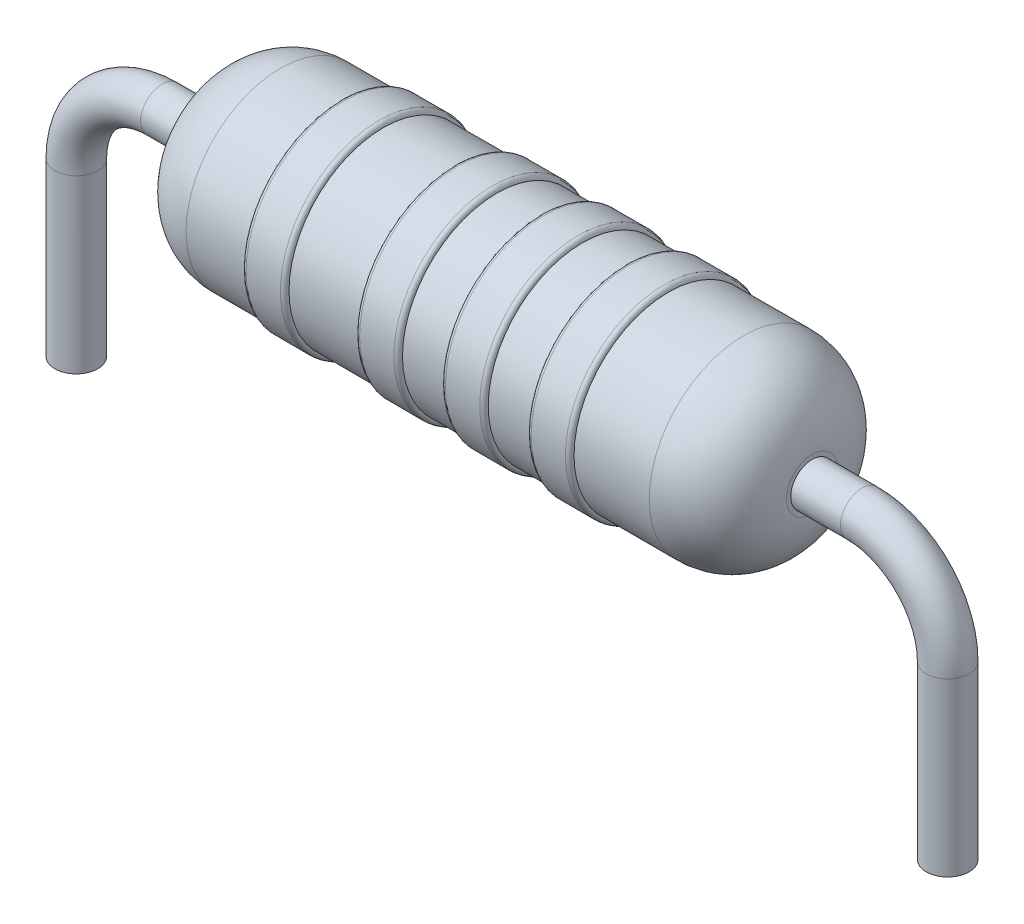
ISO-10303-21;
HEADER;
FILE_DESCRIPTION(('STEP AP214'),'2;1');
FILE_NAME('part.step','',(''),(''),'','','');
FILE_SCHEMA(('AUTOMOTIVE_DESIGN { 1 0 10303 214 1 1 1 1 }'));
ENDSEC;
DATA;
#1=APPLICATION_CONTEXT('core data for automotive mechanical design processes');
#2=APPLICATION_PROTOCOL_DEFINITION('international standard','automotive_design',2000,#1);
#3=PRODUCT_CONTEXT('',#1,'mechanical');
#4=PRODUCT('Part','Part','',(#3));
#5=PRODUCT_RELATED_PRODUCT_CATEGORY('part','',(#4));
#6=PRODUCT_DEFINITION_FORMATION('','',#4);
#7=PRODUCT_DEFINITION_CONTEXT('part definition',#1,'design');
#8=PRODUCT_DEFINITION('design','',#6,#7);
#9=PRODUCT_DEFINITION_SHAPE('','',#8);
#10=(LENGTH_UNIT() NAMED_UNIT(*) SI_UNIT(.MILLI.,.METRE.));
#11=(NAMED_UNIT(*) PLANE_ANGLE_UNIT() SI_UNIT($,.RADIAN.));
#12=(NAMED_UNIT(*) SI_UNIT($,.STERADIAN.) SOLID_ANGLE_UNIT());
#13=UNCERTAINTY_MEASURE_WITH_UNIT(LENGTH_MEASURE(1.E-05),#10,'distance_accuracy_value','');
#14=(GEOMETRIC_REPRESENTATION_CONTEXT(3) GLOBAL_UNCERTAINTY_ASSIGNED_CONTEXT((#13)) GLOBAL_UNIT_ASSIGNED_CONTEXT((#10,
#11,#12)) REPRESENTATION_CONTEXT('',''));
#15=CARTESIAN_POINT('',(0.,0.,0.));
#16=DIRECTION('',(0.,0.,1.));
#17=DIRECTION('',(1.,0.,0.));
#18=AXIS2_PLACEMENT_3D('',#15,#16,#17);
#19=CARTESIAN_POINT('',(-3.5,0.,0.));
#20=DIRECTION('',(1.,0.,0.));
#21=DIRECTION('',(0.,0.,-1.));
#22=AXIS2_PLACEMENT_3D('',#19,#20,#21);
#23=PLANE('',#22);
#24=CARTESIAN_POINT('',(-3.5,0.,0.));
#25=DIRECTION('',(-1.,0.,0.));
#26=DIRECTION('',(0.,0.,1.));
#27=AXIS2_PLACEMENT_3D('',#24,#25,#26);
#28=CIRCLE('',#27,0.299999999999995);
#29=CARTESIAN_POINT('',(-3.5,0.,0.299999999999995));
#30=VERTEX_POINT('',#29);
#31=EDGE_CURVE('E98',#30,#30,#28,.T.);
#32=ORIENTED_EDGE('',*,*,#31,.T.);
#33=EDGE_LOOP('',(#32));
#34=FACE_BOUND('',#33,.T.);
#35=CARTESIAN_POINT('',(-3.5,0.,0.));
#36=DIRECTION('',(1.,0.,0.));
#37=DIRECTION('',(0.,0.,-1.));
#38=AXIS2_PLACEMENT_3D('',#35,#36,#37);
#39=CIRCLE('',#38,0.25);
#40=CARTESIAN_POINT('',(-3.5,0.,-0.25));
#41=VERTEX_POINT('',#40);
#42=EDGE_CURVE('E10',#41,#41,#39,.F.);
#43=ORIENTED_EDGE('',*,*,#42,.F.);
#44=EDGE_LOOP('',(#43));
#45=FACE_BOUND('',#44,.T.);
#46=ADVANCED_FACE('F39',(#34,#45),#23,.F.);
#47=CARTESIAN_POINT('',(-54.2686615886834,0.,0.));
#48=DIRECTION('',(-1.,0.,0.));
#49=DIRECTION('',(0.,0.,1.));
#50=AXIS2_PLACEMENT_3D('',#47,#48,#49);
#51=CYLINDRICAL_SURFACE('',#50,1.1);
#52=CARTESIAN_POINT('',(0.322975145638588,0.,0.));
#53=DIRECTION('',(-1.,0.,0.));
#54=DIRECTION('',(0.,0.,1.));
#55=AXIS2_PLACEMENT_3D('',#52,#53,#54);
#56=CIRCLE('',#55,1.1);
#57=CARTESIAN_POINT('',(0.322975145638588,0.,1.1));
#58=VERTEX_POINT('',#57);
#59=EDGE_CURVE('E86',#58,#58,#56,.T.);
#60=ORIENTED_EDGE('',*,*,#59,.T.);
#61=EDGE_LOOP('',(#60));
#62=FACE_BOUND('',#61,.T.);
#63=CARTESIAN_POINT('',(-0.177024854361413,0.,0.));
#64=DIRECTION('',(1.,0.,0.));
#65=DIRECTION('',(0.,0.,-1.));
#66=AXIS2_PLACEMENT_3D('',#63,#64,#65);
#67=CIRCLE('',#66,1.1);
#68=CARTESIAN_POINT('',(-0.177024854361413,0.,-1.1));
#69=VERTEX_POINT('',#68);
#70=EDGE_CURVE('E95',#69,#69,#67,.T.);
#71=ORIENTED_EDGE('',*,*,#70,.T.);
#72=EDGE_LOOP('',(#71));
#73=FACE_BOUND('',#72,.T.);
#74=ADVANCED_FACE('F156',(#62,#73),#51,.T.);
#75=CARTESIAN_POINT('',(4.3261723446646,0.,0.));
#76=DIRECTION('',(1.,0.,0.));
#77=DIRECTION('',(0.,0.,-1.));
#78=AXIS2_PLACEMENT_3D('',#75,#76,#77);
#79=CYLINDRICAL_SURFACE('',#78,1.15);
#80=CARTESIAN_POINT('',(-0.627024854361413,0.,0.));
#81=DIRECTION('',(-1.,0.,0.));
#82=DIRECTION('',(0.,0.,1.));
#83=AXIS2_PLACEMENT_3D('',#80,#81,#82);
#84=CIRCLE('',#83,1.15);
#85=CARTESIAN_POINT('',(-0.627024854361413,0.,1.15));
#86=VERTEX_POINT('',#85);
#87=EDGE_CURVE('E62',#86,#86,#84,.F.);
#88=ORIENTED_EDGE('',*,*,#87,.T.);
#89=EDGE_LOOP('',(#88));
#90=FACE_BOUND('',#89,.T.);
#91=CARTESIAN_POINT('',(-0.227024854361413,0.,0.));
#92=DIRECTION('',(1.,0.,0.));
#93=DIRECTION('',(0.,0.,-1.));
#94=AXIS2_PLACEMENT_3D('',#91,#92,#93);
#95=CIRCLE('',#94,1.15);
#96=CARTESIAN_POINT('',(-0.227024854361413,0.,-1.15));
#97=VERTEX_POINT('',#96);
#98=EDGE_CURVE('E65',#97,#97,#95,.F.);
#99=ORIENTED_EDGE('',*,*,#98,.T.);
#100=EDGE_LOOP('',(#99));
#101=FACE_BOUND('',#100,.T.);
#102=ADVANCED_FACE('F162',(#90,#101),#79,.T.);
#103=CARTESIAN_POINT('',(-1.5,0.,0.));
#104=DIRECTION('',(1.,0.,0.));
#105=DIRECTION('',(0.,0.,-1.));
#106=AXIS2_PLACEMENT_3D('',#103,#104,#105);
#107=CIRCLE('',#106,1.1);
#108=CARTESIAN_POINT('',(-1.5,0.,-1.1));
#109=VERTEX_POINT('',#108);
#110=EDGE_CURVE('E79',#109,#109,#107,.T.);
#111=ORIENTED_EDGE('',*,*,#110,.T.);
#112=EDGE_LOOP('',(#111));
#113=FACE_BOUND('',#112,.T.);
#114=CARTESIAN_POINT('',(-0.677024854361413,0.,0.));
#115=DIRECTION('',(-1.,0.,0.));
#116=DIRECTION('',(0.,0.,1.));
#117=AXIS2_PLACEMENT_3D('',#114,#115,#116);
#118=CIRCLE('',#117,1.1);
#119=CARTESIAN_POINT('',(-0.677024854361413,0.,1.1));
#120=VERTEX_POINT('',#119);
#121=EDGE_CURVE('E92',#120,#120,#118,.T.);
#122=ORIENTED_EDGE('',*,*,#121,.T.);
#123=EDGE_LOOP('',(#122));
#124=FACE_BOUND('',#123,.T.);
#125=ADVANCED_FACE('F165',(#113,#124),#51,.T.);
#126=CARTESIAN_POINT('',(4.3261723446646,0.,0.));
#127=DIRECTION('',(1.,0.,0.));
#128=DIRECTION('',(0.,0.,-1.));
#129=AXIS2_PLACEMENT_3D('',#126,#127,#128);
#130=CYLINDRICAL_SURFACE('',#129,1.15);
#131=CARTESIAN_POINT('',(0.372975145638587,0.,0.));
#132=DIRECTION('',(-1.,0.,0.));
#133=DIRECTION('',(0.,0.,1.));
#134=AXIS2_PLACEMENT_3D('',#131,#132,#133);
#135=CIRCLE('',#134,1.15);
#136=CARTESIAN_POINT('',(0.372975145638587,0.,1.15));
#137=VERTEX_POINT('',#136);
#138=EDGE_CURVE('E54',#137,#137,#135,.F.);
#139=ORIENTED_EDGE('',*,*,#138,.T.);
#140=EDGE_LOOP('',(#139));
#141=FACE_BOUND('',#140,.T.);
#142=CARTESIAN_POINT('',(0.772975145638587,0.,0.));
#143=DIRECTION('',(1.,0.,0.));
#144=DIRECTION('',(0.,0.,-1.));
#145=AXIS2_PLACEMENT_3D('',#142,#143,#144);
#146=CIRCLE('',#145,1.15);
#147=CARTESIAN_POINT('',(0.772975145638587,0.,-1.15));
#148=VERTEX_POINT('',#147);
#149=EDGE_CURVE('E59',#148,#148,#146,.F.);
#150=ORIENTED_EDGE('',*,*,#149,.T.);
#151=EDGE_LOOP('',(#150));
#152=FACE_BOUND('',#151,.T.);
#153=ADVANCED_FACE('F178',(#141,#152),#130,.T.);
#154=CARTESIAN_POINT('',(1.32297514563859,0.,0.));
#155=DIRECTION('',(-1.,0.,0.));
#156=DIRECTION('',(0.,0.,1.));
#157=AXIS2_PLACEMENT_3D('',#154,#155,#156);
#158=CIRCLE('',#157,1.1);
#159=CARTESIAN_POINT('',(1.32297514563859,0.,1.1));
#160=VERTEX_POINT('',#159);
#161=EDGE_CURVE('E78',#160,#160,#158,.T.);
#162=ORIENTED_EDGE('',*,*,#161,.T.);
#163=EDGE_LOOP('',(#162));
#164=FACE_BOUND('',#163,.T.);
#165=CARTESIAN_POINT('',(0.822975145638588,0.,0.));
#166=DIRECTION('',(1.,0.,0.));
#167=DIRECTION('',(0.,0.,-1.));
#168=AXIS2_PLACEMENT_3D('',#165,#166,#167);
#169=CIRCLE('',#168,1.1);
#170=CARTESIAN_POINT('',(0.822975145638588,0.,-1.1));
#171=VERTEX_POINT('',#170);
#172=EDGE_CURVE('E89',#171,#171,#169,.T.);
#173=ORIENTED_EDGE('',*,*,#172,.T.);
#174=EDGE_LOOP('',(#173));
#175=FACE_BOUND('',#174,.T.);
#176=ADVANCED_FACE('F166',(#164,#175),#51,.T.);
#177=CARTESIAN_POINT('',(4.3261723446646,0.,0.));
#178=DIRECTION('',(1.,0.,0.));
#179=DIRECTION('',(0.,0.,-1.));
#180=AXIS2_PLACEMENT_3D('',#177,#178,#179);
#181=CYLINDRICAL_SURFACE('',#180,1.15);
#182=CARTESIAN_POINT('',(1.37297514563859,0.,0.));
#183=DIRECTION('',(-1.,0.,0.));
#184=DIRECTION('',(0.,0.,1.));
#185=AXIS2_PLACEMENT_3D('',#182,#183,#184);
#186=CIRCLE('',#185,1.15);
#187=CARTESIAN_POINT('',(1.37297514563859,0.,1.15));
#188=VERTEX_POINT('',#187);
#189=EDGE_CURVE('E46',#188,#188,#186,.F.);
#190=ORIENTED_EDGE('',*,*,#189,.T.);
#191=EDGE_LOOP('',(#190));
#192=FACE_BOUND('',#191,.T.);
#193=CARTESIAN_POINT('',(1.77297514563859,0.,0.));
#194=DIRECTION('',(1.,0.,0.));
#195=DIRECTION('',(0.,0.,-1.));
#196=AXIS2_PLACEMENT_3D('',#193,#194,#195);
#197=CIRCLE('',#196,1.15);
#198=CARTESIAN_POINT('',(1.77297514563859,0.,-1.15));
#199=VERTEX_POINT('',#198);
#200=EDGE_CURVE('E50',#199,#199,#197,.F.);
#201=ORIENTED_EDGE('',*,*,#200,.T.);
#202=EDGE_LOOP('',(#201));
#203=FACE_BOUND('',#202,.T.);
#204=ADVANCED_FACE('F188',(#192,#203),#181,.T.);
#205=CARTESIAN_POINT('',(3.5,0.299999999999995,0.));
#206=DIRECTION('',(-1.,0.,0.));
#207=DIRECTION('',(0.,0.,1.));
#208=AXIS2_PLACEMENT_3D('',#205,#206,#207);
#209=PLANE('',#208);
#210=CARTESIAN_POINT('',(3.5,0.,0.));
#211=DIRECTION('',(-1.,0.,0.));
#212=DIRECTION('',(0.,0.,1.));
#213=AXIS2_PLACEMENT_3D('',#210,#211,#212);
#214=CIRCLE('',#213,0.25);
#215=CARTESIAN_POINT('',(3.5,0.,0.25));
#216=VERTEX_POINT('',#215);
#217=EDGE_CURVE('E126',#216,#216,#214,.T.);
#218=ORIENTED_EDGE('',*,*,#217,.T.);
#219=EDGE_LOOP('',(#218));
#220=FACE_BOUND('',#219,.T.);
#221=CARTESIAN_POINT('',(3.5,0.,0.));
#222=DIRECTION('',(-1.,0.,0.));
#223=DIRECTION('',(0.,0.,1.));
#224=AXIS2_PLACEMENT_3D('',#221,#222,#223);
#225=CIRCLE('',#224,0.299999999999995);
#226=CARTESIAN_POINT('',(3.5,0.,0.299999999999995));
#227=VERTEX_POINT('',#226);
#228=EDGE_CURVE('E74',#227,#227,#225,.T.);
#229=ORIENTED_EDGE('',*,*,#228,.F.);
#230=EDGE_LOOP('',(#229));
#231=FACE_BOUND('',#230,.T.);
#232=ADVANCED_FACE('F184',(#220,#231),#209,.F.);
#233=CARTESIAN_POINT('',(2.7,0.,0.));
#234=DIRECTION('',(-1.,0.,0.));
#235=DIRECTION('',(0.,0.,1.));
#236=AXIS2_PLACEMENT_3D('',#233,#234,#235);
#237=DEGENERATE_TOROIDAL_SURFACE('',#236,0.3,0.8,.T.);
#238=CARTESIAN_POINT('',(2.69999999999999,0.,0.));
#239=DIRECTION('',(-1.,0.,0.));
#240=DIRECTION('',(0.,0.,1.));
#241=AXIS2_PLACEMENT_3D('',#238,#239,#240);
#242=CIRCLE('',#241,1.1);
#243=CARTESIAN_POINT('',(2.69999999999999,0.,1.1));
#244=VERTEX_POINT('',#243);
#245=EDGE_CURVE('E103',#244,#244,#242,.T.);
#246=ORIENTED_EDGE('',*,*,#245,.F.);
#247=EDGE_LOOP('',(#246));
#248=FACE_BOUND('',#247,.T.);
#249=ORIENTED_EDGE('',*,*,#228,.T.);
#250=EDGE_LOOP('',(#249));
#251=FACE_BOUND('',#250,.T.);
#252=ADVANCED_FACE('F180',(#248,#251),#237,.T.);
#253=CARTESIAN_POINT('',(1.82297514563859,0.,0.));
#254=DIRECTION('',(1.,0.,0.));
#255=DIRECTION('',(0.,0.,-1.));
#256=AXIS2_PLACEMENT_3D('',#253,#254,#255);
#257=CIRCLE('',#256,1.1);
#258=CARTESIAN_POINT('',(1.82297514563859,0.,-1.1));
#259=VERTEX_POINT('',#258);
#260=EDGE_CURVE('E83',#259,#259,#257,.T.);
#261=ORIENTED_EDGE('',*,*,#260,.T.);
#262=EDGE_LOOP('',(#261));
#263=FACE_BOUND('',#262,.T.);
#264=ORIENTED_EDGE('',*,*,#245,.T.);
#265=EDGE_LOOP('',(#264));
#266=FACE_BOUND('',#265,.T.);
#267=ADVANCED_FACE('F183',(#263,#266),#51,.T.);
#268=CARTESIAN_POINT('',(4.3261723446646,0.,0.));
#269=DIRECTION('',(1.,0.,0.));
#270=DIRECTION('',(0.,0.,-1.));
#271=AXIS2_PLACEMENT_3D('',#268,#269,#270);
#272=CYLINDRICAL_SURFACE('',#271,1.15);
#273=CARTESIAN_POINT('',(-1.95,0.,0.));
#274=DIRECTION('',(-1.,0.,0.));
#275=DIRECTION('',(0.,0.,1.));
#276=AXIS2_PLACEMENT_3D('',#273,#274,#275);
#277=CIRCLE('',#276,1.15);
#278=CARTESIAN_POINT('',(-1.95,0.,1.15));
#279=VERTEX_POINT('',#278);
#280=EDGE_CURVE('E68',#279,#279,#277,.F.);
#281=ORIENTED_EDGE('',*,*,#280,.T.);
#282=EDGE_LOOP('',(#281));
#283=FACE_BOUND('',#282,.T.);
#284=CARTESIAN_POINT('',(-1.55,0.,0.));
#285=DIRECTION('',(1.,0.,0.));
#286=DIRECTION('',(0.,0.,-1.));
#287=AXIS2_PLACEMENT_3D('',#284,#285,#286);
#288=CIRCLE('',#287,1.15);
#289=CARTESIAN_POINT('',(-1.55,0.,-1.15));
#290=VERTEX_POINT('',#289);
#291=EDGE_CURVE('E71',#290,#290,#288,.F.);
#292=ORIENTED_EDGE('',*,*,#291,.T.);
#293=EDGE_LOOP('',(#292));
#294=FACE_BOUND('',#293,.T.);
#295=ADVANCED_FACE('F174',(#283,#294),#272,.T.);
#296=CARTESIAN_POINT('',(-2.7,0.,0.));
#297=DIRECTION('',(-1.,0.,0.));
#298=DIRECTION('',(0.,0.,1.));
#299=AXIS2_PLACEMENT_3D('',#296,#297,#298);
#300=DEGENERATE_TOROIDAL_SURFACE('',#299,0.3,0.8,.T.);
#301=ORIENTED_EDGE('',*,*,#31,.F.);
#302=EDGE_LOOP('',(#301));
#303=FACE_BOUND('',#302,.T.);
#304=CARTESIAN_POINT('',(-2.69999999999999,0.,0.));
#305=DIRECTION('',(-1.,0.,0.));
#306=DIRECTION('',(0.,0.,1.));
#307=AXIS2_PLACEMENT_3D('',#304,#305,#306);
#308=CIRCLE('',#307,1.1);
#309=CARTESIAN_POINT('',(-2.69999999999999,0.,1.1));
#310=VERTEX_POINT('',#309);
#311=EDGE_CURVE('E106',#310,#310,#308,.T.);
#312=ORIENTED_EDGE('',*,*,#311,.T.);
#313=EDGE_LOOP('',(#312));
#314=FACE_BOUND('',#313,.T.);
#315=ADVANCED_FACE('F171',(#303,#314),#300,.T.);
#316=CARTESIAN_POINT('',(-2.,0.,0.));
#317=DIRECTION('',(-1.,0.,0.));
#318=DIRECTION('',(0.,0.,1.));
#319=AXIS2_PLACEMENT_3D('',#316,#317,#318);
#320=CIRCLE('',#319,1.1);
#321=CARTESIAN_POINT('',(-2.,0.,1.1));
#322=VERTEX_POINT('',#321);
#323=EDGE_CURVE('E75',#322,#322,#320,.T.);
#324=ORIENTED_EDGE('',*,*,#323,.T.);
#325=EDGE_LOOP('',(#324));
#326=FACE_BOUND('',#325,.T.);
#327=ORIENTED_EDGE('',*,*,#311,.F.);
#328=EDGE_LOOP('',(#327));
#329=FACE_BOUND('',#328,.T.);
#330=ADVANCED_FACE('F173',(#326,#329),#51,.T.);
#331=CARTESIAN_POINT('',(-1.95,0.,0.));
#332=DIRECTION('',(-1.,0.,0.));
#333=DIRECTION('',(0.,0.,1.));
#334=AXIS2_PLACEMENT_3D('',#331,#332,#333);
#335=TOROIDAL_SURFACE('',#334,1.1,0.05);
#336=ORIENTED_EDGE('',*,*,#323,.F.);
#337=EDGE_LOOP('',(#336));
#338=FACE_BOUND('',#337,.T.);
#339=ORIENTED_EDGE('',*,*,#280,.F.);
#340=EDGE_LOOP('',(#339));
#341=FACE_BOUND('',#340,.T.);
#342=ADVANCED_FACE('F190',(#338,#341),#335,.T.);
#343=CARTESIAN_POINT('',(-1.55,0.,0.));
#344=DIRECTION('',(1.,0.,0.));
#345=DIRECTION('',(0.,0.,-1.));
#346=AXIS2_PLACEMENT_3D('',#343,#344,#345);
#347=TOROIDAL_SURFACE('',#346,1.1,0.05);
#348=ORIENTED_EDGE('',*,*,#291,.F.);
#349=EDGE_LOOP('',(#348));
#350=FACE_BOUND('',#349,.T.);
#351=ORIENTED_EDGE('',*,*,#110,.F.);
#352=EDGE_LOOP('',(#351));
#353=FACE_BOUND('',#352,.T.);
#354=ADVANCED_FACE('F193',(#350,#353),#347,.T.);
#355=CARTESIAN_POINT('',(-0.627024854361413,0.,0.));
#356=DIRECTION('',(-1.,0.,0.));
#357=DIRECTION('',(0.,0.,1.));
#358=AXIS2_PLACEMENT_3D('',#355,#356,#357);
#359=TOROIDAL_SURFACE('',#358,1.1,0.05);
#360=ORIENTED_EDGE('',*,*,#121,.F.);
#361=EDGE_LOOP('',(#360));
#362=FACE_BOUND('',#361,.T.);
#363=ORIENTED_EDGE('',*,*,#87,.F.);
#364=EDGE_LOOP('',(#363));
#365=FACE_BOUND('',#364,.T.);
#366=ADVANCED_FACE('F197',(#362,#365),#359,.T.);
#367=CARTESIAN_POINT('',(-0.227024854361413,0.,0.));
#368=DIRECTION('',(1.,0.,0.));
#369=DIRECTION('',(0.,0.,-1.));
#370=AXIS2_PLACEMENT_3D('',#367,#368,#369);
#371=TOROIDAL_SURFACE('',#370,1.1,0.05);
#372=ORIENTED_EDGE('',*,*,#98,.F.);
#373=EDGE_LOOP('',(#372));
#374=FACE_BOUND('',#373,.T.);
#375=ORIENTED_EDGE('',*,*,#70,.F.);
#376=EDGE_LOOP('',(#375));
#377=FACE_BOUND('',#376,.T.);
#378=ADVANCED_FACE('F201',(#374,#377),#371,.T.);
#379=CARTESIAN_POINT('',(0.372975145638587,0.,0.));
#380=DIRECTION('',(-1.,0.,0.));
#381=DIRECTION('',(0.,0.,1.));
#382=AXIS2_PLACEMENT_3D('',#379,#380,#381);
#383=TOROIDAL_SURFACE('',#382,1.1,0.05);
#384=ORIENTED_EDGE('',*,*,#59,.F.);
#385=EDGE_LOOP('',(#384));
#386=FACE_BOUND('',#385,.T.);
#387=ORIENTED_EDGE('',*,*,#138,.F.);
#388=EDGE_LOOP('',(#387));
#389=FACE_BOUND('',#388,.T.);
#390=ADVANCED_FACE('F205',(#386,#389),#383,.T.);
#391=CARTESIAN_POINT('',(0.772975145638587,0.,0.));
#392=DIRECTION('',(1.,0.,0.));
#393=DIRECTION('',(0.,0.,-1.));
#394=AXIS2_PLACEMENT_3D('',#391,#392,#393);
#395=TOROIDAL_SURFACE('',#394,1.1,0.05);
#396=ORIENTED_EDGE('',*,*,#149,.F.);
#397=EDGE_LOOP('',(#396));
#398=FACE_BOUND('',#397,.T.);
#399=ORIENTED_EDGE('',*,*,#172,.F.);
#400=EDGE_LOOP('',(#399));
#401=FACE_BOUND('',#400,.T.);
#402=ADVANCED_FACE('F209',(#398,#401),#395,.T.);
#403=CARTESIAN_POINT('',(1.37297514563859,0.,0.));
#404=DIRECTION('',(-1.,0.,0.));
#405=DIRECTION('',(0.,0.,1.));
#406=AXIS2_PLACEMENT_3D('',#403,#404,#405);
#407=TOROIDAL_SURFACE('',#406,1.1,0.05);
#408=ORIENTED_EDGE('',*,*,#161,.F.);
#409=EDGE_LOOP('',(#408));
#410=FACE_BOUND('',#409,.T.);
#411=ORIENTED_EDGE('',*,*,#189,.F.);
#412=EDGE_LOOP('',(#411));
#413=FACE_BOUND('',#412,.T.);
#414=ADVANCED_FACE('F212',(#410,#413),#407,.T.);
#415=CARTESIAN_POINT('',(1.77297514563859,0.,0.));
#416=DIRECTION('',(1.,0.,0.));
#417=DIRECTION('',(0.,0.,-1.));
#418=AXIS2_PLACEMENT_3D('',#415,#416,#417);
#419=TOROIDAL_SURFACE('',#418,1.1,0.05);
#420=ORIENTED_EDGE('',*,*,#200,.F.);
#421=EDGE_LOOP('',(#420));
#422=FACE_BOUND('',#421,.T.);
#423=ORIENTED_EDGE('',*,*,#260,.F.);
#424=EDGE_LOOP('',(#423));
#425=FACE_BOUND('',#424,.T.);
#426=ADVANCED_FACE('F41',(#422,#425),#419,.T.);
#427=CARTESIAN_POINT('',(-5.08,-0.999999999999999,0.));
#428=DIRECTION('',(0.,-1.,0.));
#429=DIRECTION('',(0.,0.,-1.));
#430=AXIS2_PLACEMENT_3D('',#427,#428,#429);
#431=CYLINDRICAL_SURFACE('',#430,0.25);
#432=CARTESIAN_POINT('',(-5.08,-0.999999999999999,0.));
#433=DIRECTION('',(0.,-1.,0.));
#434=DIRECTION('',(0.,0.,1.));
#435=AXIS2_PLACEMENT_3D('',#432,#433,#434);
#436=CIRCLE('',#435,0.25);
#437=CARTESIAN_POINT('',(-5.33,-0.999999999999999,0.));
#438=VERTEX_POINT('',#437);
#439=EDGE_CURVE('E113',#438,#438,#436,.T.);
#440=ORIENTED_EDGE('',*,*,#439,.T.);
#441=EDGE_LOOP('',(#440));
#442=FACE_BOUND('',#441,.T.);
#443=CARTESIAN_POINT('',(-5.08,-3.,0.));
#444=DIRECTION('',(0.,-1.,0.));
#445=DIRECTION('',(0.,0.,1.));
#446=AXIS2_PLACEMENT_3D('',#443,#444,#445);
#447=CIRCLE('',#446,0.25);
#448=CARTESIAN_POINT('',(-5.08,-3.,0.25));
#449=VERTEX_POINT('',#448);
#450=EDGE_CURVE('E82',#449,#449,#447,.T.);
#451=ORIENTED_EDGE('',*,*,#450,.F.);
#452=EDGE_LOOP('',(#451));
#453=FACE_BOUND('',#452,.T.);
#454=ADVANCED_FACE('F219',(#442,#453),#431,.T.);
#455=CARTESIAN_POINT('',(-4.08,-1.,0.));
#456=DIRECTION('',(0.,0.,1.));
#457=DIRECTION('',(1.,0.,0.));
#458=AXIS2_PLACEMENT_3D('',#455,#456,#457);
#459=TOROIDAL_SURFACE('',#458,0.999999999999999,0.25);
#460=CARTESIAN_POINT('',(-4.08,0.,0.));
#461=DIRECTION('',(-1.,0.,0.));
#462=DIRECTION('',(0.,0.,1.));
#463=AXIS2_PLACEMENT_3D('',#460,#461,#462);
#464=CIRCLE('',#463,0.25);
#465=CARTESIAN_POINT('',(-4.08,0.25,0.));
#466=VERTEX_POINT('',#465);
#467=EDGE_CURVE('E116',#466,#466,#464,.T.);
#468=CARTESIAN_POINT('',(-4.08,-1.,0.));
#469=DIRECTION('',(0.,0.,1.));
#470=DIRECTION('',(1.,0.,0.));
#471=AXIS2_PLACEMENT_3D('',#468,#469,#470);
#472=CIRCLE('',#471,1.25);
#473=EDGE_CURVE('',#466,#438,#472,.T.);
#474=ORIENTED_EDGE('',*,*,#467,.T.);
#475=ORIENTED_EDGE('',*,*,#439,.F.);
#476=ORIENTED_EDGE('',*,*,#473,.T.);
#477=ORIENTED_EDGE('',*,*,#473,.F.);
#478=EDGE_LOOP('',(#474,#476,#475,#477));
#479=FACE_BOUND('',#478,.T.);
#480=ADVANCED_FACE('F389',(#479),#459,.T.);
#481=CARTESIAN_POINT('',(-4.08,0.,0.));
#482=DIRECTION('',(1.,0.,0.));
#483=DIRECTION('',(0.,1.,0.));
#484=AXIS2_PLACEMENT_3D('',#481,#482,#483);
#485=CYLINDRICAL_SURFACE('',#484,0.25);
#486=ORIENTED_EDGE('',*,*,#467,.F.);
#487=EDGE_LOOP('',(#486));
#488=FACE_BOUND('',#487,.T.);
#489=ORIENTED_EDGE('',*,*,#42,.T.);
#490=EDGE_LOOP('',(#489));
#491=FACE_BOUND('',#490,.T.);
#492=ADVANCED_FACE('F398',(#488,#491),#485,.T.);
#493=CARTESIAN_POINT('',(-5.08,-3.,0.));
#494=DIRECTION('',(0.,-1.,0.));
#495=DIRECTION('',(0.,0.,1.));
#496=AXIS2_PLACEMENT_3D('',#493,#494,#495);
#497=PLANE('',#496);
#498=ORIENTED_EDGE('',*,*,#450,.T.);
#499=EDGE_LOOP('',(#498));
#500=FACE_BOUND('',#499,.T.);
#501=ADVANCED_FACE('F144',(#500),#497,.T.);
#502=CARTESIAN_POINT('',(5.08,-0.999999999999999,0.));
#503=DIRECTION('',(0.,-1.,0.));
#504=DIRECTION('',(0.,0.,-1.));
#505=AXIS2_PLACEMENT_3D('',#502,#503,#504);
#506=CYLINDRICAL_SURFACE('',#505,0.25);
#507=CARTESIAN_POINT('',(5.08,-0.999999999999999,0.));
#508=DIRECTION('',(0.,1.,0.));
#509=DIRECTION('',(0.,0.,1.));
#510=AXIS2_PLACEMENT_3D('',#507,#508,#509);
#511=CIRCLE('',#510,0.25);
#512=CARTESIAN_POINT('',(5.33,-0.999999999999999,0.));
#513=VERTEX_POINT('',#512);
#514=EDGE_CURVE('E122',#513,#513,#511,.T.);
#515=ORIENTED_EDGE('',*,*,#514,.F.);
#516=EDGE_LOOP('',(#515));
#517=FACE_BOUND('',#516,.T.);
#518=CARTESIAN_POINT('',(5.08,-3.,0.));
#519=DIRECTION('',(0.,1.,0.));
#520=DIRECTION('',(0.,0.,1.));
#521=AXIS2_PLACEMENT_3D('',#518,#519,#520);
#522=CIRCLE('',#521,0.25);
#523=CARTESIAN_POINT('',(5.08,-3.,0.25));
#524=VERTEX_POINT('',#523);
#525=EDGE_CURVE('E119',#524,#524,#522,.T.);
#526=ORIENTED_EDGE('',*,*,#525,.T.);
#527=EDGE_LOOP('',(#526));
#528=FACE_BOUND('',#527,.T.);
#529=ADVANCED_FACE('F138',(#517,#528),#506,.T.);
#530=CARTESIAN_POINT('',(4.08,-1.,0.));
#531=DIRECTION('',(0.,0.,-1.));
#532=DIRECTION('',(-1.,0.,0.));
#533=AXIS2_PLACEMENT_3D('',#530,#531,#532);
#534=TOROIDAL_SURFACE('',#533,0.999999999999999,0.25);
#535=CARTESIAN_POINT('',(4.08,0.,0.));
#536=DIRECTION('',(-1.,0.,0.));
#537=DIRECTION('',(0.,0.,1.));
#538=AXIS2_PLACEMENT_3D('',#535,#536,#537);
#539=CIRCLE('',#538,0.25);
#540=CARTESIAN_POINT('',(4.08,0.25,0.));
#541=VERTEX_POINT('',#540);
#542=EDGE_CURVE('E125',#541,#541,#539,.T.);
#543=CARTESIAN_POINT('',(4.08,-1.,0.));
#544=DIRECTION('',(0.,0.,-1.));
#545=DIRECTION('',(-1.,0.,0.));
#546=AXIS2_PLACEMENT_3D('',#543,#544,#545);
#547=CIRCLE('',#546,1.25);
#548=EDGE_CURVE('',#541,#513,#547,.T.);
#549=ORIENTED_EDGE('',*,*,#542,.F.);
#550=ORIENTED_EDGE('',*,*,#514,.T.);
#551=ORIENTED_EDGE('',*,*,#548,.T.);
#552=ORIENTED_EDGE('',*,*,#548,.F.);
#553=EDGE_LOOP('',(#549,#551,#550,#552));
#554=FACE_BOUND('',#553,.T.);
#555=ADVANCED_FACE('F135',(#554),#534,.T.);
#556=CARTESIAN_POINT('',(4.08,0.,0.));
#557=DIRECTION('',(-1.,0.,0.));
#558=DIRECTION('',(0.,-1.,0.));
#559=AXIS2_PLACEMENT_3D('',#556,#557,#558);
#560=CYLINDRICAL_SURFACE('',#559,0.25);
#561=ORIENTED_EDGE('',*,*,#542,.T.);
#562=EDGE_LOOP('',(#561));
#563=FACE_BOUND('',#562,.T.);
#564=ORIENTED_EDGE('',*,*,#217,.F.);
#565=EDGE_LOOP('',(#564));
#566=FACE_BOUND('',#565,.T.);
#567=ADVANCED_FACE('F132',(#563,#566),#560,.T.);
#568=CARTESIAN_POINT('',(5.08,-3.,0.));
#569=DIRECTION('',(0.,-1.,0.));
#570=DIRECTION('',(0.,0.,1.));
#571=AXIS2_PLACEMENT_3D('',#568,#569,#570);
#572=PLANE('',#571);
#573=ORIENTED_EDGE('',*,*,#525,.F.);
#574=EDGE_LOOP('',(#573));
#575=FACE_BOUND('',#574,.T.);
#576=ADVANCED_FACE('F148',(#575),#572,.T.);
#577=CLOSED_SHELL('',(#46,#74,#102,#125,#153,#176,#204,#232,#252,#267,#295,#315,#330,#342,#354,
#366,#378,#390,#402,#414,#426,#454,#480,#492,#501,#529,#555,#567,#576));
#578=MANIFOLD_SOLID_BREP('B2',#577);
#579=ADVANCED_BREP_SHAPE_REPRESENTATION('',(#18,#578),#14);
#580=SHAPE_DEFINITION_REPRESENTATION(#9,#579);
ENDSEC;
END-ISO-10303-21;
